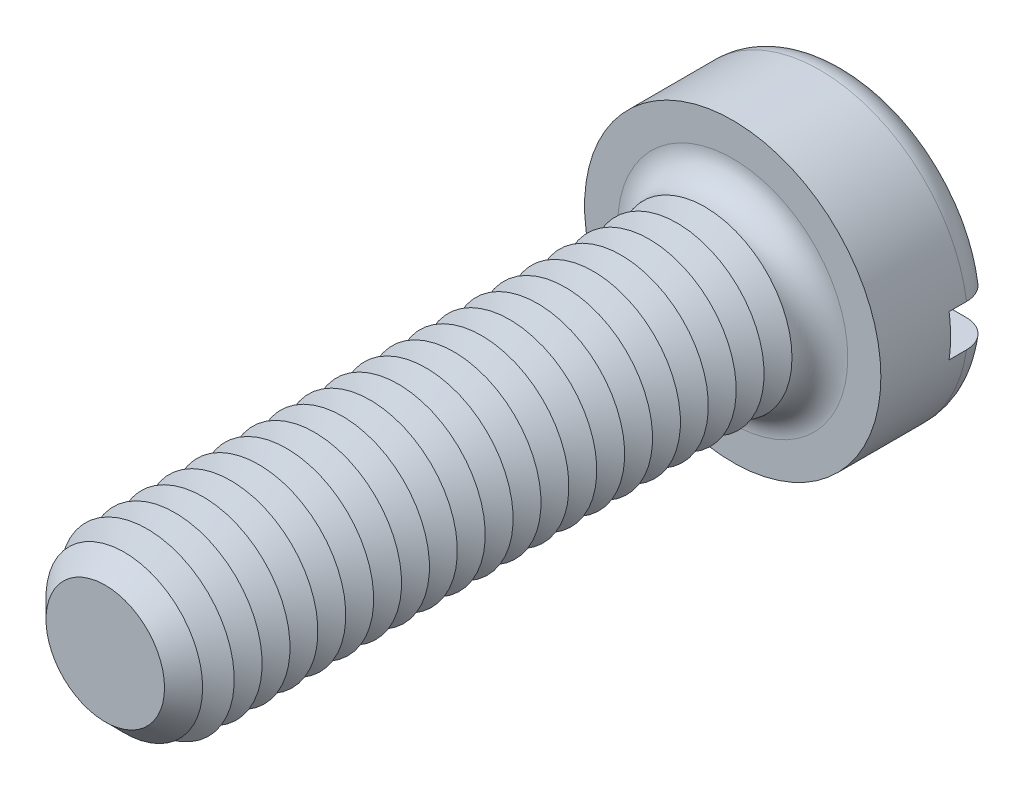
from build123d import *

# Parameters (mm, degrees)
SKETCH3_R           = 4.25
BOSS_EXTRUDE2_DEPTH = 3.3
SKETCH4_R           = 2.5
BOSS_EXTRUDE3_DEPTH = 18
FILLET1_R           = 0.8
CHAMFER1_SIZE       = 0.8
LPATTERN1_COUNT     = 21
LPATTERN1_PITCH     = 0.8
SKETCH8_W           = 8.5
SKETCH8_H           = 1.2
CUT_EXTRUDE1_DEPTH  = 1.3


with BuildPart() as part:
    # Sketch3 → Boss-Extrude2 (new body)
    with BuildSketch(Plane.XY):
        Circle(SKETCH3_R)
    extrude(amount=-BOSS_EXTRUDE2_DEPTH)

    # Sketch4 → Boss-Extrude3 (add)
    with BuildSketch(Plane.XY):
        Circle(SKETCH4_R)
    extrude(amount=BOSS_EXTRUDE3_DEPTH)

    # Fillet1
    fillet1_edges = [part.edges().sort_by_distance(p)[0] for p in [
        (-4.25, 0, -3.3),
        (-2.5, 0, 0),
    ]]
    fillet(fillet1_edges, radius=FILLET1_R)

    # Chamfer1
    chamfer1_edges = [part.edges().sort_by_distance(p)[0] for p in [
        (-2.5, 0, 18),
    ]]
    chamfer(chamfer1_edges, length=CHAMFER1_SIZE)

    # Sketch6 → Cut-Revolve1 (revolve, cut)
    with BuildSketch(Plane(origin=(0, 0, 0), x_dir=(0, 0, -1), z_dir=(1, 0, 0)), mode=Mode.PRIVATE) as cut_revolve1_sk:
        Polygon((-0.8, 2.5), (-1.2, 1.807179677), (-1.6, 2.5), align=None)
    cut_revolve1 = revolve(cut_revolve1_sk.sketch.rotate(Axis((0, 0, -1.694361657), (0, 0, 1)), 90), axis=Axis((0, 0, -1.694361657), (0, 0, 1)), mode=Mode.SUBTRACT)

    # LPattern1: Cut-Revolve1 ×21
    with Locations(*[(0, 0, i * LPATTERN1_PITCH) for i in range(1, LPATTERN1_COUNT)]):
        add(cut_revolve1, mode=Mode.SUBTRACT)

    # Sketch8 → Cut-Extrude1 (cut)
    with BuildSketch(Plane(origin=(0, 0, -3.3), x_dir=(-1, 0, 0), z_dir=(0, 0, -1))):
        Rectangle(SKETCH8_W, SKETCH8_H)
    extrude(amount=-CUT_EXTRUDE1_DEPTH, mode=Mode.SUBTRACT)


solid = part.part
